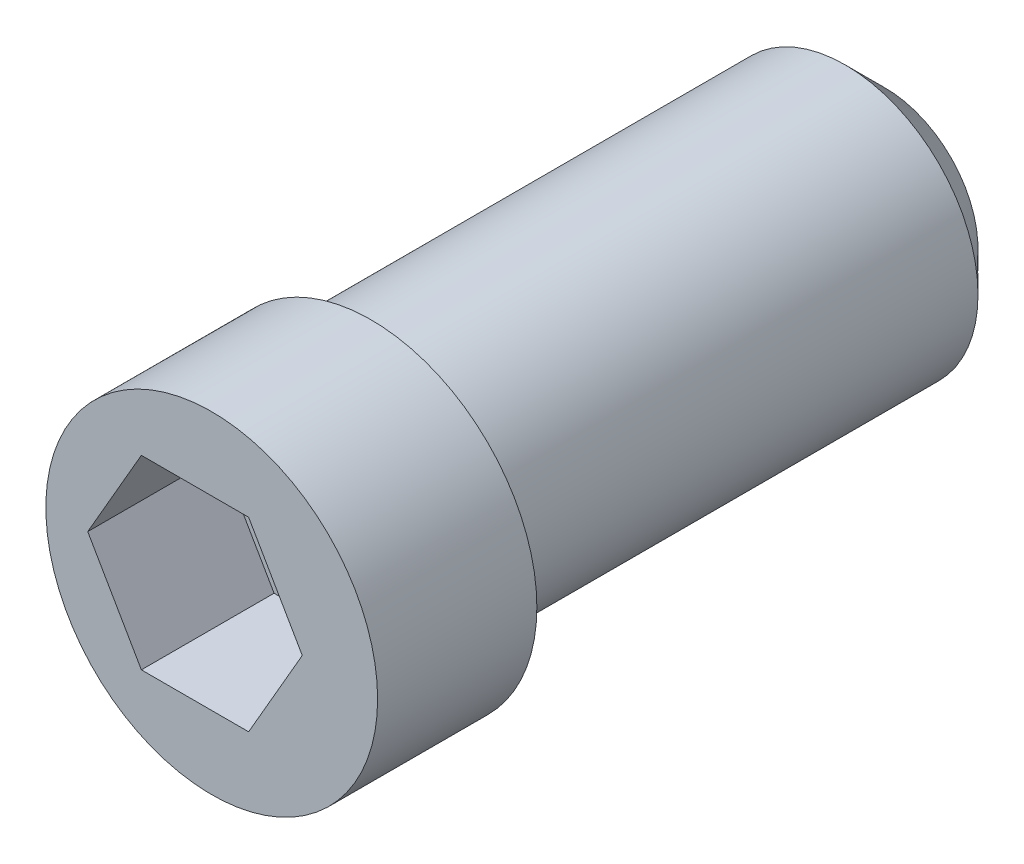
ISO-10303-21;
HEADER;
FILE_DESCRIPTION(('STEP AP214'),'2;1');
FILE_NAME('part.step','',(''),(''),'','','');
FILE_SCHEMA(('AUTOMOTIVE_DESIGN { 1 0 10303 214 1 1 1 1 }'));
ENDSEC;
DATA;
#1=APPLICATION_CONTEXT('core data for automotive mechanical design processes');
#2=APPLICATION_PROTOCOL_DEFINITION('international standard','automotive_design',2000,#1);
#3=PRODUCT_CONTEXT('',#1,'mechanical');
#4=PRODUCT('Part','Part','',(#3));
#5=PRODUCT_RELATED_PRODUCT_CATEGORY('part','',(#4));
#6=PRODUCT_DEFINITION_FORMATION('','',#4);
#7=PRODUCT_DEFINITION_CONTEXT('part definition',#1,'design');
#8=PRODUCT_DEFINITION('design','',#6,#7);
#9=PRODUCT_DEFINITION_SHAPE('','',#8);
#10=(LENGTH_UNIT() NAMED_UNIT(*) SI_UNIT(.MILLI.,.METRE.));
#11=(NAMED_UNIT(*) PLANE_ANGLE_UNIT() SI_UNIT($,.RADIAN.));
#12=(NAMED_UNIT(*) SI_UNIT($,.STERADIAN.) SOLID_ANGLE_UNIT());
#13=UNCERTAINTY_MEASURE_WITH_UNIT(LENGTH_MEASURE(1.E-05),#10,'distance_accuracy_value','');
#14=(GEOMETRIC_REPRESENTATION_CONTEXT(3) GLOBAL_UNCERTAINTY_ASSIGNED_CONTEXT((#13)) GLOBAL_UNIT_ASSIGNED_CONTEXT((#10,
#11,#12)) REPRESENTATION_CONTEXT('',''));
#15=CARTESIAN_POINT('',(0.,0.,0.));
#16=DIRECTION('',(0.,0.,1.));
#17=DIRECTION('',(1.,0.,0.));
#18=AXIS2_PLACEMENT_3D('',#15,#16,#17);
#19=CARTESIAN_POINT('',(-0.00500000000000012,-4.7625,0.));
#20=DIRECTION('',(0.,0.,1.));
#21=DIRECTION('',(-1.,0.,0.));
#22=AXIS2_PLACEMENT_3D('',#19,#20,#21);
#23=PLANE('',#22);
#24=CARTESIAN_POINT('',(0.,0.,0.));
#25=DIRECTION('',(0.,0.,1.));
#26=DIRECTION('',(1.,0.,0.));
#27=AXIS2_PLACEMENT_3D('',#24,#25,#26);
#28=CIRCLE('',#27,5.);
#29=CARTESIAN_POINT('',(5.,0.,0.));
#30=VERTEX_POINT('',#29);
#31=EDGE_CURVE('E127',#30,#30,#28,.F.);
#32=ORIENTED_EDGE('',*,*,#31,.F.);
#33=EDGE_LOOP('',(#32));
#34=FACE_BOUND('',#33,.T.);
#35=CARTESIAN_POINT('',(0.63,0.,0.));
#36=DIRECTION('',(0.,0.,1.));
#37=DIRECTION('',(1.,0.,0.));
#38=AXIS2_PLACEMENT_3D('',#35,#36,#37);
#39=CIRCLE('',#38,6.25);
#40=CARTESIAN_POINT('',(6.88,0.,0.));
#41=VERTEX_POINT('',#40);
#42=EDGE_CURVE('E124',#41,#41,#39,.T.);
#43=ORIENTED_EDGE('',*,*,#42,.F.);
#44=EDGE_LOOP('',(#43));
#45=FACE_BOUND('',#44,.T.);
#46=ADVANCED_FACE('F14',(#34,#45),#23,.F.);
#47=CARTESIAN_POINT('',(0.,0.,-20.));
#48=DIRECTION('',(0.,0.,1.));
#49=DIRECTION('',(1.,0.,0.));
#50=AXIS2_PLACEMENT_3D('',#47,#48,#49);
#51=CYLINDRICAL_SURFACE('',#50,5.);
#52=CARTESIAN_POINT('',(0.,0.,-18.5));
#53=DIRECTION('',(0.,0.,-1.));
#54=DIRECTION('',(-1.,0.,0.));
#55=AXIS2_PLACEMENT_3D('',#52,#53,#54);
#56=CIRCLE('',#55,5.);
#57=CARTESIAN_POINT('',(-5.,0.,-18.5));
#58=VERTEX_POINT('',#57);
#59=EDGE_CURVE('E9',#58,#58,#56,.F.);
#60=ORIENTED_EDGE('',*,*,#59,.T.);
#61=EDGE_LOOP('',(#60));
#62=FACE_BOUND('',#61,.T.);
#63=ORIENTED_EDGE('',*,*,#31,.T.);
#64=EDGE_LOOP('',(#63));
#65=FACE_BOUND('',#64,.T.);
#66=ADVANCED_FACE('F146',(#62,#65),#51,.T.);
#67=CARTESIAN_POINT('',(0.,0.,-20.));
#68=DIRECTION('',(0.,0.,-1.));
#69=DIRECTION('',(-1.,0.,0.));
#70=AXIS2_PLACEMENT_3D('',#67,#68,#69);
#71=PLANE('',#70);
#72=CARTESIAN_POINT('',(0.,0.,-20.));
#73=DIRECTION('',(0.,0.,-1.));
#74=DIRECTION('',(-1.,0.,0.));
#75=AXIS2_PLACEMENT_3D('',#72,#73,#74);
#76=CIRCLE('',#75,3.5);
#77=CARTESIAN_POINT('',(-3.5,0.,-20.));
#78=VERTEX_POINT('',#77);
#79=EDGE_CURVE('E22',#78,#78,#76,.T.);
#80=ORIENTED_EDGE('',*,*,#79,.T.);
#81=EDGE_LOOP('',(#80));
#82=FACE_BOUND('',#81,.T.);
#83=ADVANCED_FACE('F132',(#82),#71,.T.);
#84=CARTESIAN_POINT('',(0.,0.,-20.));
#85=DIRECTION('',(0.,0.,1.));
#86=DIRECTION('',(1.,0.,0.));
#87=AXIS2_PLACEMENT_3D('',#84,#85,#86);
#88=CONICAL_SURFACE('',#87,3.5,0.785398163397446);
#89=ORIENTED_EDGE('',*,*,#59,.F.);
#90=EDGE_LOOP('',(#89));
#91=FACE_BOUND('',#90,.T.);
#92=ORIENTED_EDGE('',*,*,#79,.F.);
#93=EDGE_LOOP('',(#92));
#94=FACE_BOUND('',#93,.T.);
#95=ADVANCED_FACE('F16',(#91,#94),#88,.T.);
#96=CARTESIAN_POINT('',(0.63,0.,-4.));
#97=DIRECTION('',(0.,0.,1.));
#98=DIRECTION('',(1.,0.,0.));
#99=AXIS2_PLACEMENT_3D('',#96,#97,#98);
#100=CYLINDRICAL_SURFACE('',#99,6.25);
#101=CARTESIAN_POINT('',(0.63,0.,6.));
#102=DIRECTION('',(0.,0.,1.));
#103=DIRECTION('',(1.,0.,0.));
#104=AXIS2_PLACEMENT_3D('',#101,#102,#103);
#105=CIRCLE('',#104,6.25);
#106=CARTESIAN_POINT('',(6.88,0.,6.));
#107=VERTEX_POINT('',#106);
#108=EDGE_CURVE('E116',#107,#107,#105,.T.);
#109=ORIENTED_EDGE('',*,*,#108,.F.);
#110=EDGE_LOOP('',(#109));
#111=FACE_BOUND('',#110,.T.);
#112=ORIENTED_EDGE('',*,*,#42,.T.);
#113=EDGE_LOOP('',(#112));
#114=FACE_BOUND('',#113,.T.);
#115=ADVANCED_FACE('F135',(#111,#114),#100,.T.);
#116=CARTESIAN_POINT('',(0.63,0.,6.));
#117=DIRECTION('',(0.,0.,-1.));
#118=DIRECTION('',(1.,0.,0.));
#119=AXIS2_PLACEMENT_3D('',#116,#117,#118);
#120=PLANE('',#119);
#121=DIRECTION('',(-0.5,0.866025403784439,0.));
#122=VECTOR('',#121,1.);
#123=CARTESIAN_POINT('',(4.04145188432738,0.,6.));
#124=LINE('',#123,#122);
#125=CARTESIAN_POINT('',(4.04145188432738,0.,6.));
#126=VERTEX_POINT('',#125);
#127=CARTESIAN_POINT('',(2.02072594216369,3.5,6.));
#128=VERTEX_POINT('',#127);
#129=EDGE_CURVE('E103',#126,#128,#124,.T.);
#130=ORIENTED_EDGE('',*,*,#129,.F.);
#131=DIRECTION('',(0.5,0.866025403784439,0.));
#132=VECTOR('',#131,1.);
#133=CARTESIAN_POINT('',(2.02072594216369,-3.5,6.));
#134=LINE('',#133,#132);
#135=CARTESIAN_POINT('',(2.02072594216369,-3.5,6.));
#136=VERTEX_POINT('',#135);
#137=EDGE_CURVE('E29',#136,#126,#134,.T.);
#138=ORIENTED_EDGE('',*,*,#137,.F.);
#139=DIRECTION('',(1.,0.,0.));
#140=VECTOR('',#139,1.);
#141=CARTESIAN_POINT('',(-2.02072594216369,-3.5,6.));
#142=LINE('',#141,#140);
#143=CARTESIAN_POINT('',(-2.02072594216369,-3.5,6.));
#144=VERTEX_POINT('',#143);
#145=EDGE_CURVE('E112',#144,#136,#142,.T.);
#146=ORIENTED_EDGE('',*,*,#145,.F.);
#147=DIRECTION('',(0.5,-0.866025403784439,0.));
#148=VECTOR('',#147,1.);
#149=CARTESIAN_POINT('',(-4.04145188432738,0.,6.));
#150=LINE('',#149,#148);
#151=CARTESIAN_POINT('',(-4.04145188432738,0.,6.));
#152=VERTEX_POINT('',#151);
#153=EDGE_CURVE('E110',#152,#144,#150,.T.);
#154=ORIENTED_EDGE('',*,*,#153,.F.);
#155=DIRECTION('',(-0.5,-0.866025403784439,0.));
#156=VECTOR('',#155,1.);
#157=CARTESIAN_POINT('',(-2.02072594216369,3.5,6.));
#158=LINE('',#157,#156);
#159=CARTESIAN_POINT('',(-2.02072594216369,3.5,6.));
#160=VERTEX_POINT('',#159);
#161=EDGE_CURVE('E77',#160,#152,#158,.T.);
#162=ORIENTED_EDGE('',*,*,#161,.F.);
#163=DIRECTION('',(-1.,0.,0.));
#164=VECTOR('',#163,1.);
#165=CARTESIAN_POINT('',(2.02072594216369,3.5,6.));
#166=LINE('',#165,#164);
#167=EDGE_CURVE('E106',#128,#160,#166,.T.);
#168=ORIENTED_EDGE('',*,*,#167,.F.);
#169=EDGE_LOOP('',(#130,#138,#146,#154,#162,#168));
#170=FACE_BOUND('',#169,.T.);
#171=ORIENTED_EDGE('',*,*,#108,.T.);
#172=EDGE_LOOP('',(#171));
#173=FACE_BOUND('',#172,.T.);
#174=ADVANCED_FACE('F143',(#170,#173),#120,.F.);
#175=CARTESIAN_POINT('',(2.02072594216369,-3.5,1.));
#176=DIRECTION('',(0.866025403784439,-0.5,0.));
#177=DIRECTION('',(0.5,0.866025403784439,0.));
#178=AXIS2_PLACEMENT_3D('',#175,#176,#177);
#179=PLANE('',#178);
#180=ORIENTED_EDGE('',*,*,#137,.T.);
#181=DIRECTION('',(0.,0.,1.));
#182=VECTOR('',#181,1.);
#183=CARTESIAN_POINT('',(4.04145188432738,0.,1.));
#184=LINE('',#183,#182);
#185=CARTESIAN_POINT('',(4.04145188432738,0.,1.));
#186=VERTEX_POINT('',#185);
#187=EDGE_CURVE('E59',#186,#126,#184,.T.);
#188=ORIENTED_EDGE('',*,*,#187,.F.);
#189=DIRECTION('',(0.5,0.866025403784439,0.));
#190=VECTOR('',#189,1.);
#191=CARTESIAN_POINT('',(2.02072594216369,-3.5,1.));
#192=LINE('',#191,#190);
#193=CARTESIAN_POINT('',(2.02072594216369,-3.5,1.));
#194=VERTEX_POINT('',#193);
#195=EDGE_CURVE('E114',#194,#186,#192,.T.);
#196=ORIENTED_EDGE('',*,*,#195,.F.);
#197=DIRECTION('',(0.,0.,1.));
#198=VECTOR('',#197,1.);
#199=CARTESIAN_POINT('',(2.02072594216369,-3.5,1.));
#200=LINE('',#199,#198);
#201=EDGE_CURVE('E37',#194,#136,#200,.T.);
#202=ORIENTED_EDGE('',*,*,#201,.T.);
#203=EDGE_LOOP('',(#180,#188,#196,#202));
#204=FACE_BOUND('',#203,.T.);
#205=ADVANCED_FACE('F161',(#204),#179,.F.);
#206=CARTESIAN_POINT('',(-2.02072594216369,-3.5,1.));
#207=DIRECTION('',(0.,-1.,0.));
#208=DIRECTION('',(0.,0.,-1.));
#209=AXIS2_PLACEMENT_3D('',#206,#207,#208);
#210=PLANE('',#209);
#211=ORIENTED_EDGE('',*,*,#145,.T.);
#212=ORIENTED_EDGE('',*,*,#201,.F.);
#213=DIRECTION('',(1.,0.,0.));
#214=VECTOR('',#213,1.);
#215=CARTESIAN_POINT('',(-2.02072594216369,-3.5,1.));
#216=LINE('',#215,#214);
#217=CARTESIAN_POINT('',(-2.02072594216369,-3.5,1.));
#218=VERTEX_POINT('',#217);
#219=EDGE_CURVE('E89',#218,#194,#216,.T.);
#220=ORIENTED_EDGE('',*,*,#219,.F.);
#221=DIRECTION('',(0.,0.,1.));
#222=VECTOR('',#221,1.);
#223=CARTESIAN_POINT('',(-2.02072594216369,-3.5,1.));
#224=LINE('',#223,#222);
#225=EDGE_CURVE('E81',#218,#144,#224,.T.);
#226=ORIENTED_EDGE('',*,*,#225,.T.);
#227=EDGE_LOOP('',(#211,#212,#220,#226));
#228=FACE_BOUND('',#227,.T.);
#229=ADVANCED_FACE('F166',(#228),#210,.F.);
#230=CARTESIAN_POINT('',(-4.04145188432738,0.,1.));
#231=DIRECTION('',(-0.866025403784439,-0.5,0.));
#232=DIRECTION('',(0.5,-0.866025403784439,0.));
#233=AXIS2_PLACEMENT_3D('',#230,#231,#232);
#234=PLANE('',#233);
#235=ORIENTED_EDGE('',*,*,#153,.T.);
#236=ORIENTED_EDGE('',*,*,#225,.F.);
#237=DIRECTION('',(0.5,-0.866025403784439,0.));
#238=VECTOR('',#237,1.);
#239=CARTESIAN_POINT('',(-4.04145188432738,0.,1.));
#240=LINE('',#239,#238);
#241=CARTESIAN_POINT('',(-4.04145188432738,0.,1.));
#242=VERTEX_POINT('',#241);
#243=EDGE_CURVE('E85',#242,#218,#240,.T.);
#244=ORIENTED_EDGE('',*,*,#243,.F.);
#245=DIRECTION('',(0.,0.,1.));
#246=VECTOR('',#245,1.);
#247=CARTESIAN_POINT('',(-4.04145188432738,0.,1.));
#248=LINE('',#247,#246);
#249=EDGE_CURVE('E70',#242,#152,#248,.T.);
#250=ORIENTED_EDGE('',*,*,#249,.T.);
#251=EDGE_LOOP('',(#235,#236,#244,#250));
#252=FACE_BOUND('',#251,.T.);
#253=ADVANCED_FACE('F86',(#252),#234,.F.);
#254=CARTESIAN_POINT('',(-2.02072594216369,3.5,1.));
#255=DIRECTION('',(-0.866025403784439,0.5,0.));
#256=DIRECTION('',(-0.5,-0.866025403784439,0.));
#257=AXIS2_PLACEMENT_3D('',#254,#255,#256);
#258=PLANE('',#257);
#259=ORIENTED_EDGE('',*,*,#161,.T.);
#260=ORIENTED_EDGE('',*,*,#249,.F.);
#261=DIRECTION('',(-0.5,-0.866025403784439,0.));
#262=VECTOR('',#261,1.);
#263=CARTESIAN_POINT('',(-2.02072594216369,3.5,1.));
#264=LINE('',#263,#262);
#265=CARTESIAN_POINT('',(-2.02072594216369,3.5,1.));
#266=VERTEX_POINT('',#265);
#267=EDGE_CURVE('E74',#266,#242,#264,.T.);
#268=ORIENTED_EDGE('',*,*,#267,.F.);
#269=DIRECTION('',(0.,0.,1.));
#270=VECTOR('',#269,1.);
#271=CARTESIAN_POINT('',(-2.02072594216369,3.5,1.));
#272=LINE('',#271,#270);
#273=EDGE_CURVE('E82',#266,#160,#272,.T.);
#274=ORIENTED_EDGE('',*,*,#273,.T.);
#275=EDGE_LOOP('',(#259,#260,#268,#274));
#276=FACE_BOUND('',#275,.T.);
#277=ADVANCED_FACE('F72',(#276),#258,.F.);
#278=CARTESIAN_POINT('',(2.02072594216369,3.5,1.));
#279=DIRECTION('',(0.,1.,0.));
#280=DIRECTION('',(-1.,0.,0.));
#281=AXIS2_PLACEMENT_3D('',#278,#279,#280);
#282=PLANE('',#281);
#283=ORIENTED_EDGE('',*,*,#167,.T.);
#284=ORIENTED_EDGE('',*,*,#273,.F.);
#285=DIRECTION('',(-1.,0.,0.));
#286=VECTOR('',#285,1.);
#287=CARTESIAN_POINT('',(2.02072594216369,3.5,1.));
#288=LINE('',#287,#286);
#289=CARTESIAN_POINT('',(2.02072594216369,3.5,1.));
#290=VERTEX_POINT('',#289);
#291=EDGE_CURVE('E95',#290,#266,#288,.T.);
#292=ORIENTED_EDGE('',*,*,#291,.F.);
#293=DIRECTION('',(0.,0.,1.));
#294=VECTOR('',#293,1.);
#295=CARTESIAN_POINT('',(2.02072594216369,3.5,1.));
#296=LINE('',#295,#294);
#297=EDGE_CURVE('E119',#290,#128,#296,.T.);
#298=ORIENTED_EDGE('',*,*,#297,.T.);
#299=EDGE_LOOP('',(#283,#284,#292,#298));
#300=FACE_BOUND('',#299,.T.);
#301=ADVANCED_FACE('F170',(#300),#282,.F.);
#302=CARTESIAN_POINT('',(4.04145188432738,0.,1.));
#303=DIRECTION('',(0.866025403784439,0.5,0.));
#304=DIRECTION('',(-0.5,0.866025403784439,0.));
#305=AXIS2_PLACEMENT_3D('',#302,#303,#304);
#306=PLANE('',#305);
#307=ORIENTED_EDGE('',*,*,#129,.T.);
#308=ORIENTED_EDGE('',*,*,#297,.F.);
#309=DIRECTION('',(-0.5,0.866025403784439,0.));
#310=VECTOR('',#309,1.);
#311=CARTESIAN_POINT('',(4.04145188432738,0.,1.));
#312=LINE('',#311,#310);
#313=EDGE_CURVE('E97',#186,#290,#312,.T.);
#314=ORIENTED_EDGE('',*,*,#313,.F.);
#315=ORIENTED_EDGE('',*,*,#187,.T.);
#316=EDGE_LOOP('',(#307,#308,#314,#315));
#317=FACE_BOUND('',#316,.T.);
#318=ADVANCED_FACE('F167',(#317),#306,.F.);
#319=CARTESIAN_POINT('',(0.,0.,1.));
#320=DIRECTION('',(0.,0.,1.));
#321=DIRECTION('',(1.,0.,0.));
#322=AXIS2_PLACEMENT_3D('',#319,#320,#321);
#323=PLANE('',#322);
#324=ORIENTED_EDGE('',*,*,#195,.T.);
#325=ORIENTED_EDGE('',*,*,#313,.T.);
#326=ORIENTED_EDGE('',*,*,#291,.T.);
#327=ORIENTED_EDGE('',*,*,#267,.T.);
#328=ORIENTED_EDGE('',*,*,#243,.T.);
#329=ORIENTED_EDGE('',*,*,#219,.T.);
#330=EDGE_LOOP('',(#324,#325,#326,#327,#328,#329));
#331=FACE_BOUND('',#330,.T.);
#332=ADVANCED_FACE('F92',(#331),#323,.T.);
#333=CLOSED_SHELL('',(#46,#66,#83,#95,#115,#174,#205,#229,#253,#277,#301,#318,#332));
#334=MANIFOLD_SOLID_BREP('B1',#333);
#335=ADVANCED_BREP_SHAPE_REPRESENTATION('',(#18,#334),#14);
#336=SHAPE_DEFINITION_REPRESENTATION(#9,#335);
ENDSEC;
END-ISO-10303-21;
